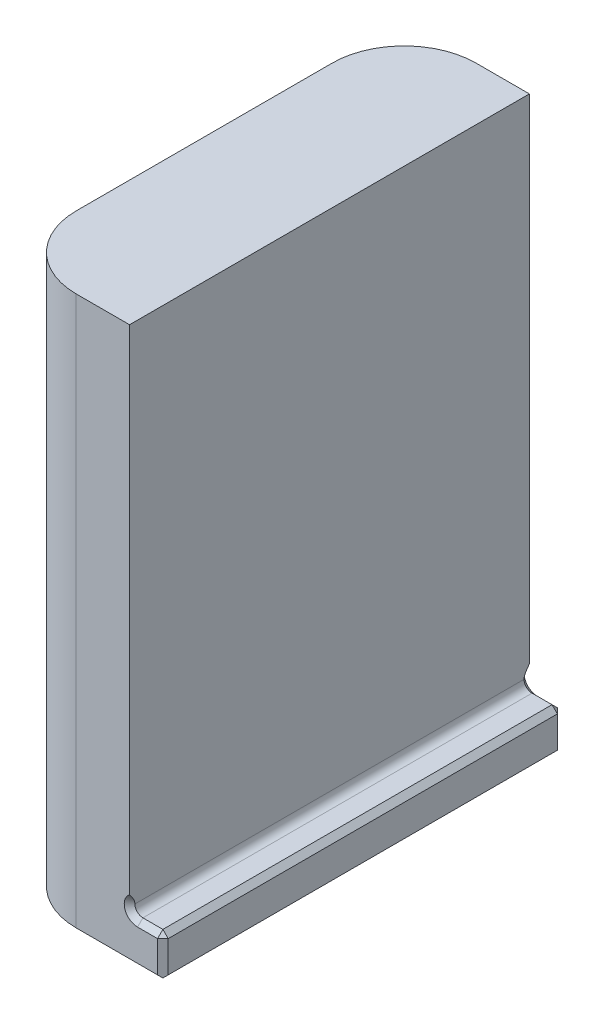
ISO-10303-21;
HEADER;
FILE_DESCRIPTION(('STEP AP214'),'2;1');
FILE_NAME('part.step','',(''),(''),'','','');
FILE_SCHEMA(('AUTOMOTIVE_DESIGN { 1 0 10303 214 1 1 1 1 }'));
ENDSEC;
DATA;
#1=APPLICATION_CONTEXT('core data for automotive mechanical design processes');
#2=APPLICATION_PROTOCOL_DEFINITION('international standard','automotive_design',2000,#1);
#3=PRODUCT_CONTEXT('',#1,'mechanical');
#4=PRODUCT('Part','Part','',(#3));
#5=PRODUCT_RELATED_PRODUCT_CATEGORY('part','',(#4));
#6=PRODUCT_DEFINITION_FORMATION('','',#4);
#7=PRODUCT_DEFINITION_CONTEXT('part definition',#1,'design');
#8=PRODUCT_DEFINITION('design','',#6,#7);
#9=PRODUCT_DEFINITION_SHAPE('','',#8);
#10=(LENGTH_UNIT() NAMED_UNIT(*) SI_UNIT(.MILLI.,.METRE.));
#11=(NAMED_UNIT(*) PLANE_ANGLE_UNIT() SI_UNIT($,.RADIAN.));
#12=(NAMED_UNIT(*) SI_UNIT($,.STERADIAN.) SOLID_ANGLE_UNIT());
#13=UNCERTAINTY_MEASURE_WITH_UNIT(LENGTH_MEASURE(1.E-05),#10,'distance_accuracy_value','');
#14=(GEOMETRIC_REPRESENTATION_CONTEXT(3) GLOBAL_UNCERTAINTY_ASSIGNED_CONTEXT((#13)) GLOBAL_UNIT_ASSIGNED_CONTEXT((#10,
#11,#12)) REPRESENTATION_CONTEXT('',''));
#15=CARTESIAN_POINT('',(0.,0.,0.));
#16=DIRECTION('',(0.,0.,1.));
#17=DIRECTION('',(1.,0.,0.));
#18=AXIS2_PLACEMENT_3D('',#15,#16,#17);
#19=CARTESIAN_POINT('',(5.969,0.,9.525));
#20=DIRECTION('',(0.,-1.,0.));
#21=DIRECTION('',(1.,0.,0.));
#22=AXIS2_PLACEMENT_3D('',#19,#20,#21);
#23=PLANE('',#22);
#24=DIRECTION('',(-1.,0.,0.));
#25=VECTOR('',#24,1.);
#26=CARTESIAN_POINT('',(5.969,0.,-9.525));
#27=LINE('',#26,#25);
#28=CARTESIAN_POINT('',(5.969,0.,-9.525));
#29=VERTEX_POINT('',#28);
#30=CARTESIAN_POINT('',(3.429,0.,-9.525));
#31=VERTEX_POINT('',#30);
#32=EDGE_CURVE('E187',#29,#31,#27,.T.);
#33=ORIENTED_EDGE('',*,*,#32,.T.);
#34=CARTESIAN_POINT('',(3.429,0.,-6.096));
#35=DIRECTION('',(0.,-1.,0.));
#36=DIRECTION('',(1.,0.,0.));
#37=AXIS2_PLACEMENT_3D('',#34,#35,#36);
#38=CIRCLE('',#37,3.429);
#39=CARTESIAN_POINT('',(0.,0.,-6.096));
#40=VERTEX_POINT('',#39);
#41=EDGE_CURVE('E208',#31,#40,#38,.F.);
#42=ORIENTED_EDGE('',*,*,#41,.T.);
#43=DIRECTION('',(0.,0.,-1.));
#44=VECTOR('',#43,1.);
#45=CARTESIAN_POINT('',(0.,0.,9.525));
#46=LINE('',#45,#44);
#47=CARTESIAN_POINT('',(0.,0.,6.096));
#48=VERTEX_POINT('',#47);
#49=EDGE_CURVE('E197',#48,#40,#46,.T.);
#50=ORIENTED_EDGE('',*,*,#49,.F.);
#51=CARTESIAN_POINT('',(3.429,0.,6.096));
#52=DIRECTION('',(0.,-1.,0.));
#53=DIRECTION('',(1.,0.,0.));
#54=AXIS2_PLACEMENT_3D('',#51,#52,#53);
#55=CIRCLE('',#54,3.429);
#56=CARTESIAN_POINT('',(3.429,0.,9.525));
#57=VERTEX_POINT('',#56);
#58=EDGE_CURVE('E185',#48,#57,#55,.F.);
#59=ORIENTED_EDGE('',*,*,#58,.T.);
#60=DIRECTION('',(-1.,0.,0.));
#61=VECTOR('',#60,1.);
#62=CARTESIAN_POINT('',(5.969,0.,9.525));
#63=LINE('',#62,#61);
#64=CARTESIAN_POINT('',(5.969,0.,9.525));
#65=VERTEX_POINT('',#64);
#66=EDGE_CURVE('E167',#65,#57,#63,.T.);
#67=ORIENTED_EDGE('',*,*,#66,.F.);
#68=DIRECTION('',(0.,0.,-1.));
#69=VECTOR('',#68,1.);
#70=CARTESIAN_POINT('',(5.969,0.,9.525));
#71=LINE('',#70,#69);
#72=EDGE_CURVE('E172',#65,#29,#71,.T.);
#73=ORIENTED_EDGE('',*,*,#72,.T.);
#74=EDGE_LOOP('',(#33,#42,#50,#59,#67,#73));
#75=FACE_BOUND('',#74,.T.);
#76=ADVANCED_FACE('F34',(#75),#23,.F.);
#77=CARTESIAN_POINT('',(0.,0.,9.525));
#78=DIRECTION('',(1.,0.,0.));
#79=DIRECTION('',(0.,1.,0.));
#80=AXIS2_PLACEMENT_3D('',#77,#78,#79);
#81=PLANE('',#80);
#82=DIRECTION('',(0.,-1.,0.));
#83=VECTOR('',#82,1.);
#84=CARTESIAN_POINT('',(0.,-26.924,-6.096));
#85=LINE('',#84,#83);
#86=CARTESIAN_POINT('',(0.,-26.162,-6.096));
#87=VERTEX_POINT('',#86);
#88=EDGE_CURVE('E202',#40,#87,#85,.T.);
#89=ORIENTED_EDGE('',*,*,#88,.T.);
#90=DIRECTION('',(0.,0.,1.));
#91=VECTOR('',#90,1.);
#92=CARTESIAN_POINT('',(0.,-26.162,9.525));
#93=LINE('',#92,#91);
#94=CARTESIAN_POINT('',(0.,-26.162,6.096));
#95=VERTEX_POINT('',#94);
#96=EDGE_CURVE('E230',#87,#95,#93,.T.);
#97=ORIENTED_EDGE('',*,*,#96,.T.);
#98=DIRECTION('',(0.,-1.,0.));
#99=VECTOR('',#98,1.);
#100=CARTESIAN_POINT('',(0.,0.,6.096));
#101=LINE('',#100,#99);
#102=EDGE_CURVE('E200',#95,#48,#101,.F.);
#103=ORIENTED_EDGE('',*,*,#102,.T.);
#104=ORIENTED_EDGE('',*,*,#49,.T.);
#105=EDGE_LOOP('',(#89,#97,#103,#104));
#106=FACE_BOUND('',#105,.T.);
#107=ADVANCED_FACE('F295',(#106),#81,.F.);
#108=CARTESIAN_POINT('',(0.,-26.924,9.525));
#109=DIRECTION('',(0.,1.,0.));
#110=DIRECTION('',(0.,0.,1.));
#111=AXIS2_PLACEMENT_3D('',#108,#109,#110);
#112=PLANE('',#111);
#113=DIRECTION('',(0.,0.,-1.));
#114=VECTOR('',#113,1.);
#115=CARTESIAN_POINT('',(0.762000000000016,-26.924,9.525));
#116=LINE('',#115,#114);
#117=CARTESIAN_POINT('',(0.762000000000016,-26.924,6.096));
#118=VERTEX_POINT('',#117);
#119=CARTESIAN_POINT('',(0.762000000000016,-26.924,-6.096));
#120=VERTEX_POINT('',#119);
#121=EDGE_CURVE('E222',#118,#120,#116,.T.);
#122=ORIENTED_EDGE('',*,*,#121,.T.);
#123=CARTESIAN_POINT('',(3.429,-26.924,-6.096));
#124=DIRECTION('',(0.,1.,0.));
#125=DIRECTION('',(0.,0.,1.));
#126=AXIS2_PLACEMENT_3D('',#123,#124,#125);
#127=CIRCLE('',#126,2.66699999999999);
#128=CARTESIAN_POINT('',(3.429,-26.924,-8.76299999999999));
#129=VERTEX_POINT('',#128);
#130=EDGE_CURVE('E224',#120,#129,#127,.F.);
#131=ORIENTED_EDGE('',*,*,#130,.T.);
#132=DIRECTION('',(1.,0.,0.));
#133=VECTOR('',#132,1.);
#134=CARTESIAN_POINT('',(7.5565,-26.924,-8.76299999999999));
#135=LINE('',#134,#133);
#136=CARTESIAN_POINT('',(6.79449999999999,-26.924,-8.76299999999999));
#137=VERTEX_POINT('',#136);
#138=EDGE_CURVE('E217',#129,#137,#135,.T.);
#139=ORIENTED_EDGE('',*,*,#138,.T.);
#140=DIRECTION('',(0.,0.,1.));
#141=VECTOR('',#140,1.);
#142=CARTESIAN_POINT('',(6.79449999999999,-26.924,9.525));
#143=LINE('',#142,#141);
#144=CARTESIAN_POINT('',(6.79449999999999,-26.924,8.76299999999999));
#145=VERTEX_POINT('',#144);
#146=EDGE_CURVE('E214',#137,#145,#143,.T.);
#147=ORIENTED_EDGE('',*,*,#146,.T.);
#148=DIRECTION('',(-1.,0.,0.));
#149=VECTOR('',#148,1.);
#150=CARTESIAN_POINT('',(0.,-26.924,8.76299999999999));
#151=LINE('',#150,#149);
#152=CARTESIAN_POINT('',(3.429,-26.924,8.76299999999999));
#153=VERTEX_POINT('',#152);
#154=EDGE_CURVE('E212',#145,#153,#151,.T.);
#155=ORIENTED_EDGE('',*,*,#154,.T.);
#156=CARTESIAN_POINT('',(3.429,-26.924,6.096));
#157=DIRECTION('',(0.,1.,0.));
#158=DIRECTION('',(0.,0.,1.));
#159=AXIS2_PLACEMENT_3D('',#156,#157,#158);
#160=CIRCLE('',#159,2.66699999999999);
#161=EDGE_CURVE('E220',#153,#118,#160,.F.);
#162=ORIENTED_EDGE('',*,*,#161,.T.);
#163=EDGE_LOOP('',(#122,#131,#139,#147,#155,#162));
#164=FACE_BOUND('',#163,.T.);
#165=ADVANCED_FACE('F291',(#164),#112,.F.);
#166=CARTESIAN_POINT('',(7.5565,-26.924,9.525));
#167=DIRECTION('',(-1.,0.,0.));
#168=DIRECTION('',(0.,0.,1.));
#169=AXIS2_PLACEMENT_3D('',#166,#167,#168);
#170=PLANE('',#169);
#171=DIRECTION('',(0.,0.,-1.));
#172=VECTOR('',#171,1.);
#173=CARTESIAN_POINT('',(7.5565,-26.162,9.525));
#174=LINE('',#173,#172);
#175=CARTESIAN_POINT('',(7.5565,-26.162,9.27099999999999));
#176=VERTEX_POINT('',#175);
#177=CARTESIAN_POINT('',(7.5565,-26.162,-9.27099999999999));
#178=VERTEX_POINT('',#177);
#179=EDGE_CURVE('E236',#176,#178,#174,.T.);
#180=ORIENTED_EDGE('',*,*,#179,.T.);
#181=DIRECTION('',(0.,1.,0.));
#182=VECTOR('',#181,1.);
#183=CARTESIAN_POINT('',(7.5565,-24.4094,-9.27099999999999));
#184=LINE('',#183,#182);
#185=CARTESIAN_POINT('',(7.5565,-24.6634,-9.27099999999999));
#186=VERTEX_POINT('',#185);
#187=EDGE_CURVE('E448',#178,#186,#184,.T.);
#188=ORIENTED_EDGE('',*,*,#187,.T.);
#189=DIRECTION('',(0.,0.,1.));
#190=VECTOR('',#189,1.);
#191=CARTESIAN_POINT('',(7.5565,-24.6634,9.525));
#192=LINE('',#191,#190);
#193=CARTESIAN_POINT('',(7.5565,-24.6634,9.27099999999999));
#194=VERTEX_POINT('',#193);
#195=EDGE_CURVE('E452',#186,#194,#192,.T.);
#196=ORIENTED_EDGE('',*,*,#195,.T.);
#197=DIRECTION('',(0.,-1.,0.));
#198=VECTOR('',#197,1.);
#199=CARTESIAN_POINT('',(7.5565,-26.924,9.27099999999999));
#200=LINE('',#199,#198);
#201=EDGE_CURVE('E450',#194,#176,#200,.T.);
#202=ORIENTED_EDGE('',*,*,#201,.T.);
#203=EDGE_LOOP('',(#180,#188,#196,#202));
#204=FACE_BOUND('',#203,.T.);
#205=ADVANCED_FACE('F288',(#204),#170,.F.);
#206=CARTESIAN_POINT('',(7.5565,-24.4094,9.525));
#207=DIRECTION('',(0.,-1.,0.));
#208=DIRECTION('',(0.,0.,-1.));
#209=AXIS2_PLACEMENT_3D('',#206,#207,#208);
#210=PLANE('',#209);
#211=DIRECTION('',(0.,0.,-1.));
#212=VECTOR('',#211,1.);
#213=CARTESIAN_POINT('',(7.30249999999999,-24.4094,9.525));
#214=LINE('',#213,#212);
#215=CARTESIAN_POINT('',(7.30249999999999,-24.4094,9.27099999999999));
#216=VERTEX_POINT('',#215);
#217=CARTESIAN_POINT('',(7.30249999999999,-24.4094,-9.27099999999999));
#218=VERTEX_POINT('',#217);
#219=EDGE_CURVE('E53',#216,#218,#214,.T.);
#220=ORIENTED_EDGE('',*,*,#219,.T.);
#221=DIRECTION('',(-1.,0.,0.));
#222=VECTOR('',#221,1.);
#223=CARTESIAN_POINT('',(6.35,-24.4094,-9.27099999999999));
#224=LINE('',#223,#222);
#225=CARTESIAN_POINT('',(6.35,-24.4094,-9.27099999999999));
#226=VERTEX_POINT('',#225);
#227=EDGE_CURVE('E45',#218,#226,#224,.T.);
#228=ORIENTED_EDGE('',*,*,#227,.T.);
#229=DIRECTION('',(0.,0.,-1.));
#230=VECTOR('',#229,1.);
#231=CARTESIAN_POINT('',(6.35,-24.4094,9.525));
#232=LINE('',#231,#230);
#233=CARTESIAN_POINT('',(6.35,-24.4094,9.27099999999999));
#234=VERTEX_POINT('',#233);
#235=EDGE_CURVE('E194',#234,#226,#232,.T.);
#236=ORIENTED_EDGE('',*,*,#235,.F.);
#237=DIRECTION('',(1.,0.,0.));
#238=VECTOR('',#237,1.);
#239=CARTESIAN_POINT('',(7.5565,-24.4094,9.27099999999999));
#240=LINE('',#239,#238);
#241=EDGE_CURVE('E58',#234,#216,#240,.T.);
#242=ORIENTED_EDGE('',*,*,#241,.T.);
#243=EDGE_LOOP('',(#220,#228,#236,#242));
#244=FACE_BOUND('',#243,.T.);
#245=ADVANCED_FACE('F284',(#244),#210,.F.);
#246=CARTESIAN_POINT('',(6.35,-24.0284,9.525));
#247=DIRECTION('',(0.,0.,-1.));
#248=DIRECTION('',(-1.,0.,0.));
#249=AXIS2_PLACEMENT_3D('',#246,#247,#248);
#250=CYLINDRICAL_SURFACE('',#249,0.381);
#251=DIRECTION('',(0.,0.,-1.));
#252=VECTOR('',#251,1.);
#253=CARTESIAN_POINT('',(5.969,-24.0284,9.525));
#254=LINE('',#253,#252);
#255=CARTESIAN_POINT('',(5.969,-24.0284,9.27099999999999));
#256=VERTEX_POINT('',#255);
#257=CARTESIAN_POINT('',(5.969,-24.0284,-9.27099999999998));
#258=VERTEX_POINT('',#257);
#259=EDGE_CURVE('E181',#256,#258,#254,.T.);
#260=ORIENTED_EDGE('',*,*,#259,.F.);
#261=CARTESIAN_POINT('',(6.35,-24.0284,9.27099999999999));
#262=DIRECTION('',(0.,0.,-1.));
#263=DIRECTION('',(-1.,0.,0.));
#264=AXIS2_PLACEMENT_3D('',#261,#262,#263);
#265=CIRCLE('',#264,0.381);
#266=EDGE_CURVE('E459',#256,#234,#265,.F.);
#267=ORIENTED_EDGE('',*,*,#266,.T.);
#268=ORIENTED_EDGE('',*,*,#235,.T.);
#269=CARTESIAN_POINT('',(6.35,-24.0284,-9.27099999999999));
#270=DIRECTION('',(0.,0.,-1.));
#271=DIRECTION('',(-1.,0.,0.));
#272=AXIS2_PLACEMENT_3D('',#269,#270,#271);
#273=CIRCLE('',#272,0.381);
#274=EDGE_CURVE('E460',#226,#258,#273,.T.);
#275=ORIENTED_EDGE('',*,*,#274,.T.);
#276=EDGE_LOOP('',(#260,#267,#268,#275));
#277=FACE_BOUND('',#276,.T.);
#278=ADVANCED_FACE('F278',(#277),#250,.F.);
#279=CARTESIAN_POINT('',(5.969,-24.0284,9.525));
#280=DIRECTION('',(-1.,0.,0.));
#281=DIRECTION('',(0.,-1.,0.));
#282=AXIS2_PLACEMENT_3D('',#279,#280,#281);
#283=PLANE('',#282);
#284=DIRECTION('',(0.,1.,0.));
#285=VECTOR('',#284,1.);
#286=CARTESIAN_POINT('',(5.969,-24.0284,9.525));
#287=LINE('',#286,#285);
#288=CARTESIAN_POINT('',(5.969,-23.5204,9.525));
#289=VERTEX_POINT('',#288);
#290=EDGE_CURVE('E162',#289,#65,#287,.T.);
#291=ORIENTED_EDGE('',*,*,#290,.F.);
#292=CARTESIAN_POINT('',(5.969,-23.5204,9.525));
#293=CARTESIAN_POINT('',(5.969,-23.5392528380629,9.50993164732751));
#294=CARTESIAN_POINT('',(5.969,-23.5582437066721,9.49502838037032));
#295=CARTESIAN_POINT('',(5.969,-23.5966376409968,9.465692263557));
#296=CARTESIAN_POINT('',(5.969,-23.6160413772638,9.4512602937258));
#297=CARTESIAN_POINT('',(5.969,-23.656021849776,9.4225658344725));
#298=CARTESIAN_POINT('',(5.969,-23.676615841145,9.4083271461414));
#299=CARTESIAN_POINT('',(5.969,-23.7184683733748,9.38088629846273));
#300=CARTESIAN_POINT('',(5.969,-23.7397264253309,9.36768340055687));
#301=CARTESIAN_POINT('',(5.969,-23.7881488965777,9.33988690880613));
#302=CARTESIAN_POINT('',(5.969,-23.8155406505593,9.32567980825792));
#303=CARTESIAN_POINT('',(5.969,-23.8717075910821,9.30120402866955));
#304=CARTESIAN_POINT('',(5.969,-23.9004590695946,9.29088470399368));
#305=CARTESIAN_POINT('',(5.969,-23.9459500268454,9.27951535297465));
#306=CARTESIAN_POINT('',(5.969,-23.9621594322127,9.27638461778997));
#307=CARTESIAN_POINT('',(5.969,-23.9950320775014,9.2720980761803));
#308=CARTESIAN_POINT('',(5.969,-24.0116984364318,9.27096665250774));
#309=CARTESIAN_POINT('',(5.969,-24.0284,9.27099999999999));
#310=B_SPLINE_CURVE_WITH_KNOTS('',3,(#292,#293,#294,#295,#296,#297,#298,#299,#300,#301,#302,
#303,#304,#305,#306,#307,#308,#309),.UNSPECIFIED.,.F.,.F.,(4,2,2,2,2,2,2,2,4),(0.,
0.0724102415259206,0.144948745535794,0.220037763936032,0.295072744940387,0.387492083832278,
0.478662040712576,0.528072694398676,0.578081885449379),.UNSPECIFIED.);
#311=EDGE_CURVE('E267',#289,#256,#310,.T.);
#312=ORIENTED_EDGE('',*,*,#311,.T.);
#313=ORIENTED_EDGE('',*,*,#259,.T.);
#314=CARTESIAN_POINT('',(5.969,-24.0284,-9.27099999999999));
#315=CARTESIAN_POINT('',(5.969,-24.0166787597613,-9.2709916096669));
#316=CARTESIAN_POINT('',(5.969,-24.0049658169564,-9.27154124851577));
#317=CARTESIAN_POINT('',(5.969,-23.9816590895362,-9.27368325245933));
#318=CARTESIAN_POINT('',(5.969,-23.9700651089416,-9.27527346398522));
#319=CARTESIAN_POINT('',(5.969,-23.9359498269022,-9.28142552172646));
#320=CARTESIAN_POINT('',(5.969,-23.9136754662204,-9.28737419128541));
#321=CARTESIAN_POINT('',(5.969,-23.8679910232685,-9.3027725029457));
#322=CARTESIAN_POINT('',(5.969,-23.8446822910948,-9.31250718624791));
#323=CARTESIAN_POINT('',(5.969,-23.7991135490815,-9.33422024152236));
#324=CARTESIAN_POINT('',(5.969,-23.7768556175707,-9.3462028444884));
#325=CARTESIAN_POINT('',(5.969,-23.7329061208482,-9.37182423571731));
#326=CARTESIAN_POINT('',(5.969,-23.7112270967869,-9.38548413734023));
#327=CARTESIAN_POINT('',(5.969,-23.6685493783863,-9.41383173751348));
#328=CARTESIAN_POINT('',(5.969,-23.6475509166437,-9.42851978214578));
#329=CARTESIAN_POINT('',(5.969,-23.6085967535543,-9.4567789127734));
#330=CARTESIAN_POINT('',(5.969,-23.5905815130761,-9.47026867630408));
#331=CARTESIAN_POINT('',(5.969,-23.5551414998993,-9.49746241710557));
#332=CARTESIAN_POINT('',(5.969,-23.5377119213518,-9.51116011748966));
#333=CARTESIAN_POINT('',(5.969,-23.5204,-9.52499999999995));
#334=B_SPLINE_CURVE_WITH_KNOTS('',3,(#314,#315,#316,#317,#318,#319,#320,#321,#322,#323,#324,
#325,#326,#327,#328,#329,#330,#331,#332,#333),.UNSPECIFIED.,.F.,.F.,(4,2,2,2,2,2,2,2,2,4),(0.,
0.0351366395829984,0.0702007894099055,0.139087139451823,0.214697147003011,0.290450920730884,
0.367281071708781,0.44413720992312,0.511648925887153,0.578144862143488),.UNSPECIFIED.);
#335=CARTESIAN_POINT('',(5.969,-23.5204,-9.525));
#336=VERTEX_POINT('',#335);
#337=EDGE_CURVE('E260',#258,#336,#334,.T.);
#338=ORIENTED_EDGE('',*,*,#337,.T.);
#339=DIRECTION('',(0.,1.,0.));
#340=VECTOR('',#339,1.);
#341=CARTESIAN_POINT('',(5.969,-24.0284,-9.525));
#342=LINE('',#341,#340);
#343=EDGE_CURVE('E177',#336,#29,#342,.T.);
#344=ORIENTED_EDGE('',*,*,#343,.T.);
#345=ORIENTED_EDGE('',*,*,#72,.F.);
#346=EDGE_LOOP('',(#291,#312,#313,#338,#344,#345));
#347=FACE_BOUND('',#346,.T.);
#348=ADVANCED_FACE('F175',(#347),#283,.F.);
#349=CARTESIAN_POINT('',(6.35,-24.0284,9.525));
#350=DIRECTION('',(0.,0.,-1.));
#351=DIRECTION('',(-1.,0.,0.));
#352=AXIS2_PLACEMENT_3D('',#349,#350,#351);
#353=PLANE('',#352);
#354=DIRECTION('',(-1.,0.,0.));
#355=VECTOR('',#354,1.);
#356=CARTESIAN_POINT('',(6.35,-24.6634,9.525));
#357=LINE('',#356,#355);
#358=CARTESIAN_POINT('',(7.30249999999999,-24.6634,9.525));
#359=VERTEX_POINT('',#358);
#360=CARTESIAN_POINT('',(6.35,-24.6634,9.525));
#361=VERTEX_POINT('',#360);
#362=EDGE_CURVE('E242',#359,#361,#357,.T.);
#363=ORIENTED_EDGE('',*,*,#362,.T.);
#364=CARTESIAN_POINT('',(6.35,-24.0284,9.525));
#365=DIRECTION('',(0.,0.,-1.));
#366=DIRECTION('',(-1.,0.,0.));
#367=AXIS2_PLACEMENT_3D('',#364,#365,#366);
#368=CIRCLE('',#367,0.635000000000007);
#369=EDGE_CURVE('E170',#361,#289,#368,.T.);
#370=ORIENTED_EDGE('',*,*,#369,.T.);
#371=ORIENTED_EDGE('',*,*,#290,.T.);
#372=ORIENTED_EDGE('',*,*,#66,.T.);
#373=DIRECTION('',(0.,-1.,0.));
#374=VECTOR('',#373,1.);
#375=CARTESIAN_POINT('',(3.429,-24.0284,9.525));
#376=LINE('',#375,#374);
#377=CARTESIAN_POINT('',(3.429,-26.162,9.525));
#378=VERTEX_POINT('',#377);
#379=EDGE_CURVE('E210',#57,#378,#376,.T.);
#380=ORIENTED_EDGE('',*,*,#379,.T.);
#381=DIRECTION('',(1.,0.,0.));
#382=VECTOR('',#381,1.);
#383=CARTESIAN_POINT('',(6.35,-26.162,9.525));
#384=LINE('',#383,#382);
#385=CARTESIAN_POINT('',(7.30249999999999,-26.162,9.525));
#386=VERTEX_POINT('',#385);
#387=EDGE_CURVE('E239',#378,#386,#384,.T.);
#388=ORIENTED_EDGE('',*,*,#387,.T.);
#389=DIRECTION('',(0.,1.,0.));
#390=VECTOR('',#389,1.);
#391=CARTESIAN_POINT('',(7.30249999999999,-24.0284,9.525));
#392=LINE('',#391,#390);
#393=EDGE_CURVE('E257',#386,#359,#392,.T.);
#394=ORIENTED_EDGE('',*,*,#393,.T.);
#395=EDGE_LOOP('',(#363,#370,#371,#372,#380,#388,#394));
#396=FACE_BOUND('',#395,.T.);
#397=ADVANCED_FACE('F164',(#396),#353,.F.);
#398=CARTESIAN_POINT('',(6.35,-24.0284,-9.525));
#399=DIRECTION('',(0.,0.,-1.));
#400=DIRECTION('',(-1.,0.,0.));
#401=AXIS2_PLACEMENT_3D('',#398,#399,#400);
#402=PLANE('',#401);
#403=ORIENTED_EDGE('',*,*,#343,.F.);
#404=CARTESIAN_POINT('',(6.35,-24.0284,-9.525));
#405=DIRECTION('',(0.,0.,-1.));
#406=DIRECTION('',(-1.,0.,0.));
#407=AXIS2_PLACEMENT_3D('',#404,#405,#406);
#408=CIRCLE('',#407,0.635000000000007);
#409=CARTESIAN_POINT('',(6.35,-24.6634,-9.525));
#410=VERTEX_POINT('',#409);
#411=EDGE_CURVE('E454',#336,#410,#408,.F.);
#412=ORIENTED_EDGE('',*,*,#411,.T.);
#413=DIRECTION('',(1.,0.,0.));
#414=VECTOR('',#413,1.);
#415=CARTESIAN_POINT('',(7.5565,-24.6634,-9.525));
#416=LINE('',#415,#414);
#417=CARTESIAN_POINT('',(7.30249999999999,-24.6634,-9.525));
#418=VERTEX_POINT('',#417);
#419=EDGE_CURVE('E415',#410,#418,#416,.T.);
#420=ORIENTED_EDGE('',*,*,#419,.T.);
#421=DIRECTION('',(0.,-1.,0.));
#422=VECTOR('',#421,1.);
#423=CARTESIAN_POINT('',(7.30249999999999,-26.162,-9.525));
#424=LINE('',#423,#422);
#425=CARTESIAN_POINT('',(7.30249999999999,-26.162,-9.525));
#426=VERTEX_POINT('',#425);
#427=EDGE_CURVE('E456',#418,#426,#424,.T.);
#428=ORIENTED_EDGE('',*,*,#427,.T.);
#429=DIRECTION('',(-1.,0.,0.));
#430=VECTOR('',#429,1.);
#431=CARTESIAN_POINT('',(3.429,-26.162,-9.525));
#432=LINE('',#431,#430);
#433=CARTESIAN_POINT('',(3.429,-26.162,-9.525));
#434=VERTEX_POINT('',#433);
#435=EDGE_CURVE('E234',#426,#434,#432,.T.);
#436=ORIENTED_EDGE('',*,*,#435,.T.);
#437=DIRECTION('',(0.,-1.,0.));
#438=VECTOR('',#437,1.);
#439=CARTESIAN_POINT('',(3.429,0.,-9.525));
#440=LINE('',#439,#438);
#441=EDGE_CURVE('E205',#434,#31,#440,.F.);
#442=ORIENTED_EDGE('',*,*,#441,.T.);
#443=ORIENTED_EDGE('',*,*,#32,.F.);
#444=EDGE_LOOP('',(#403,#412,#420,#428,#436,#442,#443));
#445=FACE_BOUND('',#444,.T.);
#446=ADVANCED_FACE('F279',(#445),#402,.T.);
#447=CARTESIAN_POINT('',(3.429,0.,-6.096));
#448=DIRECTION('',(0.,1.,0.));
#449=DIRECTION('',(-1.,0.,0.));
#450=AXIS2_PLACEMENT_3D('',#447,#448,#449);
#451=CYLINDRICAL_SURFACE('',#450,3.429);
#452=ORIENTED_EDGE('',*,*,#441,.F.);
#453=CARTESIAN_POINT('',(3.429,-26.162,-6.096));
#454=DIRECTION('',(0.,1.,0.));
#455=DIRECTION('',(-1.,0.,0.));
#456=AXIS2_PLACEMENT_3D('',#453,#454,#455);
#457=CIRCLE('',#456,3.429);
#458=EDGE_CURVE('E227',#434,#87,#457,.T.);
#459=ORIENTED_EDGE('',*,*,#458,.T.);
#460=ORIENTED_EDGE('',*,*,#88,.F.);
#461=ORIENTED_EDGE('',*,*,#41,.F.);
#462=EDGE_LOOP('',(#452,#459,#460,#461));
#463=FACE_BOUND('',#462,.T.);
#464=ADVANCED_FACE('F302',(#463),#451,.T.);
#465=CARTESIAN_POINT('',(3.429,-24.0284,6.096));
#466=DIRECTION('',(0.,-1.,0.));
#467=DIRECTION('',(1.,0.,0.));
#468=AXIS2_PLACEMENT_3D('',#465,#466,#467);
#469=CYLINDRICAL_SURFACE('',#468,3.429);
#470=ORIENTED_EDGE('',*,*,#102,.F.);
#471=CARTESIAN_POINT('',(3.429,-26.162,6.096));
#472=DIRECTION('',(0.,1.,0.));
#473=DIRECTION('',(0.,0.,1.));
#474=AXIS2_PLACEMENT_3D('',#471,#472,#473);
#475=CIRCLE('',#474,3.429);
#476=EDGE_CURVE('E232',#95,#378,#475,.T.);
#477=ORIENTED_EDGE('',*,*,#476,.T.);
#478=ORIENTED_EDGE('',*,*,#379,.F.);
#479=ORIENTED_EDGE('',*,*,#58,.F.);
#480=EDGE_LOOP('',(#470,#477,#478,#479));
#481=FACE_BOUND('',#480,.T.);
#482=ADVANCED_FACE('F305',(#481),#469,.T.);
#483=CARTESIAN_POINT('',(6.35,-26.162,9.525));
#484=DIRECTION('',(0.,0.707106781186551,-0.707106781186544));
#485=DIRECTION('',(1.,0.,0.));
#486=AXIS2_PLACEMENT_3D('',#483,#484,#485);
#487=PLANE('',#486);
#488=DIRECTION('',(0.577350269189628,0.577350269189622,0.577350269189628));
#489=VECTOR('',#488,1.);
#490=CARTESIAN_POINT('',(7.15433333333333,-26.5641666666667,9.12283333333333));
#491=LINE('',#490,#489);
#492=CARTESIAN_POINT('',(7.4295,-26.289,9.398));
#493=VERTEX_POINT('',#492);
#494=EDGE_CURVE('E252',#493,#145,#491,.F.);
#495=ORIENTED_EDGE('',*,*,#494,.F.);
#496=DIRECTION('',(-0.577350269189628,0.577350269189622,0.577350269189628));
#497=VECTOR('',#496,1.);
#498=CARTESIAN_POINT('',(6.98499999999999,-25.8445,9.8425));
#499=LINE('',#498,#497);
#500=EDGE_CURVE('E11',#493,#386,#499,.T.);
#501=ORIENTED_EDGE('',*,*,#500,.T.);
#502=ORIENTED_EDGE('',*,*,#387,.F.);
#503=DIRECTION('',(0.,0.707106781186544,0.707106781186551));
#504=VECTOR('',#503,1.);
#505=CARTESIAN_POINT('',(3.429,-26.924,8.76299999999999));
#506=LINE('',#505,#504);
#507=EDGE_CURVE('E190',#153,#378,#506,.T.);
#508=ORIENTED_EDGE('',*,*,#507,.F.);
#509=ORIENTED_EDGE('',*,*,#154,.F.);
#510=EDGE_LOOP('',(#495,#501,#502,#508,#509));
#511=FACE_BOUND('',#510,.T.);
#512=ADVANCED_FACE('F309',(#511),#487,.F.);
#513=CARTESIAN_POINT('',(3.429,-26.924,6.096));
#514=DIRECTION('',(0.,1.,0.));
#515=DIRECTION('',(0.,0.,1.));
#516=AXIS2_PLACEMENT_3D('',#513,#514,#515);
#517=CONICAL_SURFACE('',#516,2.66699999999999,0.785398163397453);
#518=ORIENTED_EDGE('',*,*,#507,.T.);
#519=ORIENTED_EDGE('',*,*,#476,.F.);
#520=DIRECTION('',(-0.707106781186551,0.707106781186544,0.));
#521=VECTOR('',#520,1.);
#522=CARTESIAN_POINT('',(0.762000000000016,-26.924,6.096));
#523=LINE('',#522,#521);
#524=EDGE_CURVE('E249',#118,#95,#523,.T.);
#525=ORIENTED_EDGE('',*,*,#524,.F.);
#526=ORIENTED_EDGE('',*,*,#161,.F.);
#527=EDGE_LOOP('',(#518,#519,#525,#526));
#528=FACE_BOUND('',#527,.T.);
#529=ADVANCED_FACE('F339',(#528),#517,.T.);
#530=CARTESIAN_POINT('',(7.5565,-26.162,9.525));
#531=DIRECTION('',(-0.707106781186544,0.707106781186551,0.));
#532=DIRECTION('',(0.,0.,-1.));
#533=AXIS2_PLACEMENT_3D('',#530,#531,#532);
#534=PLANE('',#533);
#535=DIRECTION('',(-0.577350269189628,-0.577350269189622,0.577350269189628));
#536=VECTOR('',#535,1.);
#537=CARTESIAN_POINT('',(1.20649999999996,-32.512,-3.17499999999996));
#538=LINE('',#537,#536);
#539=CARTESIAN_POINT('',(7.4295,-26.289,-9.398));
#540=VERTEX_POINT('',#539);
#541=EDGE_CURVE('E247',#540,#137,#538,.T.);
#542=ORIENTED_EDGE('',*,*,#541,.F.);
#543=DIRECTION('',(-0.577350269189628,-0.577350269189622,-0.577350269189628));
#544=VECTOR('',#543,1.);
#545=CARTESIAN_POINT('',(13.8218333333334,-19.8966666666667,-3.00566666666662));
#546=LINE('',#545,#544);
#547=EDGE_CURVE('E442',#540,#178,#546,.F.);
#548=ORIENTED_EDGE('',*,*,#547,.T.);
#549=ORIENTED_EDGE('',*,*,#179,.F.);
#550=DIRECTION('',(-0.577350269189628,-0.577350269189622,0.577350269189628));
#551=VECTOR('',#550,1.);
#552=CARTESIAN_POINT('',(7.47183333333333,-26.2466666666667,9.35566666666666));
#553=LINE('',#552,#551);
#554=EDGE_CURVE('E444',#176,#493,#553,.T.);
#555=ORIENTED_EDGE('',*,*,#554,.T.);
#556=ORIENTED_EDGE('',*,*,#494,.T.);
#557=ORIENTED_EDGE('',*,*,#146,.F.);
#558=EDGE_LOOP('',(#542,#548,#549,#555,#556,#557));
#559=FACE_BOUND('',#558,.T.);
#560=ADVANCED_FACE('F332',(#559),#534,.F.);
#561=CARTESIAN_POINT('',(0.762000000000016,-26.924,9.525));
#562=DIRECTION('',(0.707106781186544,0.707106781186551,0.));
#563=DIRECTION('',(0.,0.,-1.));
#564=AXIS2_PLACEMENT_3D('',#561,#562,#563);
#565=PLANE('',#564);
#566=ORIENTED_EDGE('',*,*,#524,.T.);
#567=ORIENTED_EDGE('',*,*,#96,.F.);
#568=DIRECTION('',(-0.707106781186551,0.707106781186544,0.));
#569=VECTOR('',#568,1.);
#570=CARTESIAN_POINT('',(0.762000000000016,-26.924,-6.096));
#571=LINE('',#570,#569);
#572=EDGE_CURVE('E245',#120,#87,#571,.T.);
#573=ORIENTED_EDGE('',*,*,#572,.F.);
#574=ORIENTED_EDGE('',*,*,#121,.F.);
#575=EDGE_LOOP('',(#566,#567,#573,#574));
#576=FACE_BOUND('',#575,.T.);
#577=ADVANCED_FACE('F325',(#576),#565,.F.);
#578=CARTESIAN_POINT('',(0.,-26.924,-8.76299999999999));
#579=DIRECTION('',(0.,-0.707106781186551,-0.707106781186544));
#580=DIRECTION('',(-1.,0.,0.));
#581=AXIS2_PLACEMENT_3D('',#578,#579,#580);
#582=PLANE('',#581);
#583=ORIENTED_EDGE('',*,*,#435,.F.);
#584=DIRECTION('',(0.577350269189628,-0.577350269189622,0.577350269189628));
#585=VECTOR('',#584,1.);
#586=CARTESIAN_POINT('',(5.37633333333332,-24.2358333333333,-11.4511666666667));
#587=LINE('',#586,#585);
#588=EDGE_CURVE('E446',#426,#540,#587,.T.);
#589=ORIENTED_EDGE('',*,*,#588,.T.);
#590=ORIENTED_EDGE('',*,*,#541,.T.);
#591=ORIENTED_EDGE('',*,*,#138,.F.);
#592=DIRECTION('',(0.,-0.707106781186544,0.707106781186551));
#593=VECTOR('',#592,1.);
#594=CARTESIAN_POINT('',(3.429,-26.162,-9.525));
#595=LINE('',#594,#593);
#596=EDGE_CURVE('E243',#434,#129,#595,.T.);
#597=ORIENTED_EDGE('',*,*,#596,.F.);
#598=EDGE_LOOP('',(#583,#589,#590,#591,#597));
#599=FACE_BOUND('',#598,.T.);
#600=ADVANCED_FACE('F318',(#599),#582,.T.);
#601=CARTESIAN_POINT('',(3.429,-26.924,-6.096));
#602=DIRECTION('',(0.,1.,0.));
#603=DIRECTION('',(-1.,0.,0.));
#604=AXIS2_PLACEMENT_3D('',#601,#602,#603);
#605=CONICAL_SURFACE('',#604,2.66699999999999,0.785398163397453);
#606=ORIENTED_EDGE('',*,*,#572,.T.);
#607=ORIENTED_EDGE('',*,*,#458,.F.);
#608=ORIENTED_EDGE('',*,*,#596,.T.);
#609=ORIENTED_EDGE('',*,*,#130,.F.);
#610=EDGE_LOOP('',(#606,#607,#608,#609));
#611=FACE_BOUND('',#610,.T.);
#612=ADVANCED_FACE('F312',(#611),#605,.T.);
#613=CARTESIAN_POINT('',(6.35,-24.0284,-9.27099999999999));
#614=DIRECTION('',(0.,0.,-1.));
#615=DIRECTION('',(-1.,0.,0.));
#616=AXIS2_PLACEMENT_3D('',#613,#614,#615);
#617=CONICAL_SURFACE('',#616,0.381,0.78539816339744);
#618=ORIENTED_EDGE('',*,*,#337,.F.);
#619=ORIENTED_EDGE('',*,*,#274,.F.);
#620=DIRECTION('',(0.,0.707106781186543,0.707106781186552));
#621=VECTOR('',#620,1.);
#622=CARTESIAN_POINT('',(6.35,-24.6634,-9.525));
#623=LINE('',#622,#621);
#624=EDGE_CURVE('E40',#410,#226,#623,.T.);
#625=ORIENTED_EDGE('',*,*,#624,.F.);
#626=ORIENTED_EDGE('',*,*,#411,.F.);
#627=EDGE_LOOP('',(#618,#619,#625,#626));
#628=FACE_BOUND('',#627,.T.);
#629=ADVANCED_FACE('F37',(#628),#617,.F.);
#630=CARTESIAN_POINT('',(7.5565,-24.4094,-9.27099999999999));
#631=DIRECTION('',(0.,0.707106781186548,-0.707106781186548));
#632=DIRECTION('',(1.,0.,0.));
#633=AXIS2_PLACEMENT_3D('',#630,#631,#632);
#634=PLANE('',#633);
#635=ORIENTED_EDGE('',*,*,#624,.T.);
#636=ORIENTED_EDGE('',*,*,#227,.F.);
#637=DIRECTION('',(0.,0.707106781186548,0.707106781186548));
#638=VECTOR('',#637,1.);
#639=CARTESIAN_POINT('',(7.30249999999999,-24.5364,-9.398));
#640=LINE('',#639,#638);
#641=EDGE_CURVE('E418',#418,#218,#640,.T.);
#642=ORIENTED_EDGE('',*,*,#641,.F.);
#643=ORIENTED_EDGE('',*,*,#419,.F.);
#644=EDGE_LOOP('',(#635,#636,#642,#643));
#645=FACE_BOUND('',#644,.T.);
#646=ADVANCED_FACE('F400',(#645),#634,.T.);
#647=CARTESIAN_POINT('',(7.5565,-26.924,-9.27099999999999));
#648=DIRECTION('',(0.707106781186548,0.,-0.707106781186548));
#649=DIRECTION('',(0.,-1.,0.));
#650=AXIS2_PLACEMENT_3D('',#647,#648,#649);
#651=PLANE('',#650);
#652=ORIENTED_EDGE('',*,*,#588,.F.);
#653=ORIENTED_EDGE('',*,*,#427,.F.);
#654=DIRECTION('',(-0.707106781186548,0.,-0.707106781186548));
#655=VECTOR('',#654,1.);
#656=CARTESIAN_POINT('',(7.5565,-24.6634,-9.27099999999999));
#657=LINE('',#656,#655);
#658=EDGE_CURVE('E419',#186,#418,#657,.T.);
#659=ORIENTED_EDGE('',*,*,#658,.F.);
#660=ORIENTED_EDGE('',*,*,#187,.F.);
#661=ORIENTED_EDGE('',*,*,#547,.F.);
#662=EDGE_LOOP('',(#652,#653,#659,#660,#661));
#663=FACE_BOUND('',#662,.T.);
#664=ADVANCED_FACE('F394',(#663),#651,.T.);
#665=CARTESIAN_POINT('',(7.5565,-24.6634,-9.27099999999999));
#666=DIRECTION('',(0.577350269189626,0.577350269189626,-0.577350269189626));
#667=DIRECTION('',(-0.707106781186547,0.,-0.707106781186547));
#668=AXIS2_PLACEMENT_3D('',#665,#666,#667);
#669=PLANE('',#668);
#670=ORIENTED_EDGE('',*,*,#658,.T.);
#671=ORIENTED_EDGE('',*,*,#641,.T.);
#672=DIRECTION('',(-0.707106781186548,0.707106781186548,0.));
#673=VECTOR('',#672,1.);
#674=CARTESIAN_POINT('',(7.5565,-24.6634,-9.27099999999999));
#675=LINE('',#674,#673);
#676=EDGE_CURVE('E423',#186,#218,#675,.T.);
#677=ORIENTED_EDGE('',*,*,#676,.F.);
#678=EDGE_LOOP('',(#670,#671,#677));
#679=FACE_BOUND('',#678,.T.);
#680=ADVANCED_FACE('F387',(#679),#669,.T.);
#681=CARTESIAN_POINT('',(7.30249999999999,-24.4094,9.525));
#682=DIRECTION('',(-0.707106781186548,-0.707106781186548,0.));
#683=DIRECTION('',(0.,0.,-1.));
#684=AXIS2_PLACEMENT_3D('',#681,#682,#683);
#685=PLANE('',#684);
#686=ORIENTED_EDGE('',*,*,#676,.T.);
#687=ORIENTED_EDGE('',*,*,#219,.F.);
#688=DIRECTION('',(0.707106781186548,-0.707106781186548,0.));
#689=VECTOR('',#688,1.);
#690=CARTESIAN_POINT('',(7.4295,-24.5364,9.27099999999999));
#691=LINE('',#690,#689);
#692=EDGE_CURVE('E427',#194,#216,#691,.F.);
#693=ORIENTED_EDGE('',*,*,#692,.F.);
#694=ORIENTED_EDGE('',*,*,#195,.F.);
#695=EDGE_LOOP('',(#686,#687,#693,#694));
#696=FACE_BOUND('',#695,.T.);
#697=ADVANCED_FACE('F380',(#696),#685,.F.);
#698=CARTESIAN_POINT('',(7.30249999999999,-24.0284,9.525));
#699=DIRECTION('',(-0.707106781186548,0.,-0.707106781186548));
#700=DIRECTION('',(0.,1.,0.));
#701=AXIS2_PLACEMENT_3D('',#698,#699,#700);
#702=PLANE('',#701);
#703=ORIENTED_EDGE('',*,*,#554,.F.);
#704=ORIENTED_EDGE('',*,*,#201,.F.);
#705=DIRECTION('',(-0.707106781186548,0.,0.707106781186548));
#706=VECTOR('',#705,1.);
#707=CARTESIAN_POINT('',(7.30249999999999,-24.6634,9.525));
#708=LINE('',#707,#706);
#709=EDGE_CURVE('E430',#359,#194,#708,.F.);
#710=ORIENTED_EDGE('',*,*,#709,.F.);
#711=ORIENTED_EDGE('',*,*,#393,.F.);
#712=ORIENTED_EDGE('',*,*,#500,.F.);
#713=EDGE_LOOP('',(#703,#704,#710,#711,#712));
#714=FACE_BOUND('',#713,.T.);
#715=ADVANCED_FACE('F373',(#714),#702,.F.);
#716=CARTESIAN_POINT('',(7.30249999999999,-24.6634,9.525));
#717=DIRECTION('',(0.577350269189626,0.577350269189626,0.577350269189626));
#718=DIRECTION('',(0.707106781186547,0.,-0.707106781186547));
#719=AXIS2_PLACEMENT_3D('',#716,#717,#718);
#720=PLANE('',#719);
#721=ORIENTED_EDGE('',*,*,#709,.T.);
#722=ORIENTED_EDGE('',*,*,#692,.T.);
#723=DIRECTION('',(0.,0.707106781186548,-0.707106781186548));
#724=VECTOR('',#723,1.);
#725=CARTESIAN_POINT('',(7.30249999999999,-24.6634,9.525));
#726=LINE('',#725,#724);
#727=EDGE_CURVE('E433',#359,#216,#726,.T.);
#728=ORIENTED_EDGE('',*,*,#727,.F.);
#729=EDGE_LOOP('',(#721,#722,#728));
#730=FACE_BOUND('',#729,.T.);
#731=ADVANCED_FACE('F366',(#730),#720,.T.);
#732=CARTESIAN_POINT('',(6.35,-24.6634,9.525));
#733=DIRECTION('',(0.,-0.707106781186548,-0.707106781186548));
#734=DIRECTION('',(-1.,0.,0.));
#735=AXIS2_PLACEMENT_3D('',#732,#733,#734);
#736=PLANE('',#735);
#737=ORIENTED_EDGE('',*,*,#727,.T.);
#738=ORIENTED_EDGE('',*,*,#241,.F.);
#739=DIRECTION('',(0.,0.707106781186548,-0.707106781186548));
#740=VECTOR('',#739,1.);
#741=CARTESIAN_POINT('',(6.35,-24.6634,9.525));
#742=LINE('',#741,#740);
#743=EDGE_CURVE('E436',#361,#234,#742,.T.);
#744=ORIENTED_EDGE('',*,*,#743,.F.);
#745=ORIENTED_EDGE('',*,*,#362,.F.);
#746=EDGE_LOOP('',(#737,#738,#744,#745));
#747=FACE_BOUND('',#746,.T.);
#748=ADVANCED_FACE('F359',(#747),#736,.F.);
#749=CARTESIAN_POINT('',(6.35,-24.0284,9.525));
#750=DIRECTION('',(0.,0.,1.));
#751=DIRECTION('',(1.,0.,0.));
#752=AXIS2_PLACEMENT_3D('',#749,#750,#751);
#753=CONICAL_SURFACE('',#752,0.635000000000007,0.785398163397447);
#754=ORIENTED_EDGE('',*,*,#743,.T.);
#755=ORIENTED_EDGE('',*,*,#266,.F.);
#756=ORIENTED_EDGE('',*,*,#311,.F.);
#757=ORIENTED_EDGE('',*,*,#369,.F.);
#758=EDGE_LOOP('',(#754,#755,#756,#757));
#759=FACE_BOUND('',#758,.T.);
#760=ADVANCED_FACE('F352',(#759),#753,.F.);
#761=CLOSED_SHELL('',(#76,#107,#165,#205,#245,#278,#348,#397,#446,#464,#482,#512,#529,#560,#577,
#600,#612,#629,#646,#664,#680,#697,#715,#731,#748,#760));
#762=MANIFOLD_SOLID_BREP('B2',#761);
#763=ADVANCED_BREP_SHAPE_REPRESENTATION('',(#18,#762),#14);
#764=SHAPE_DEFINITION_REPRESENTATION(#9,#763);
ENDSEC;
END-ISO-10303-21;
